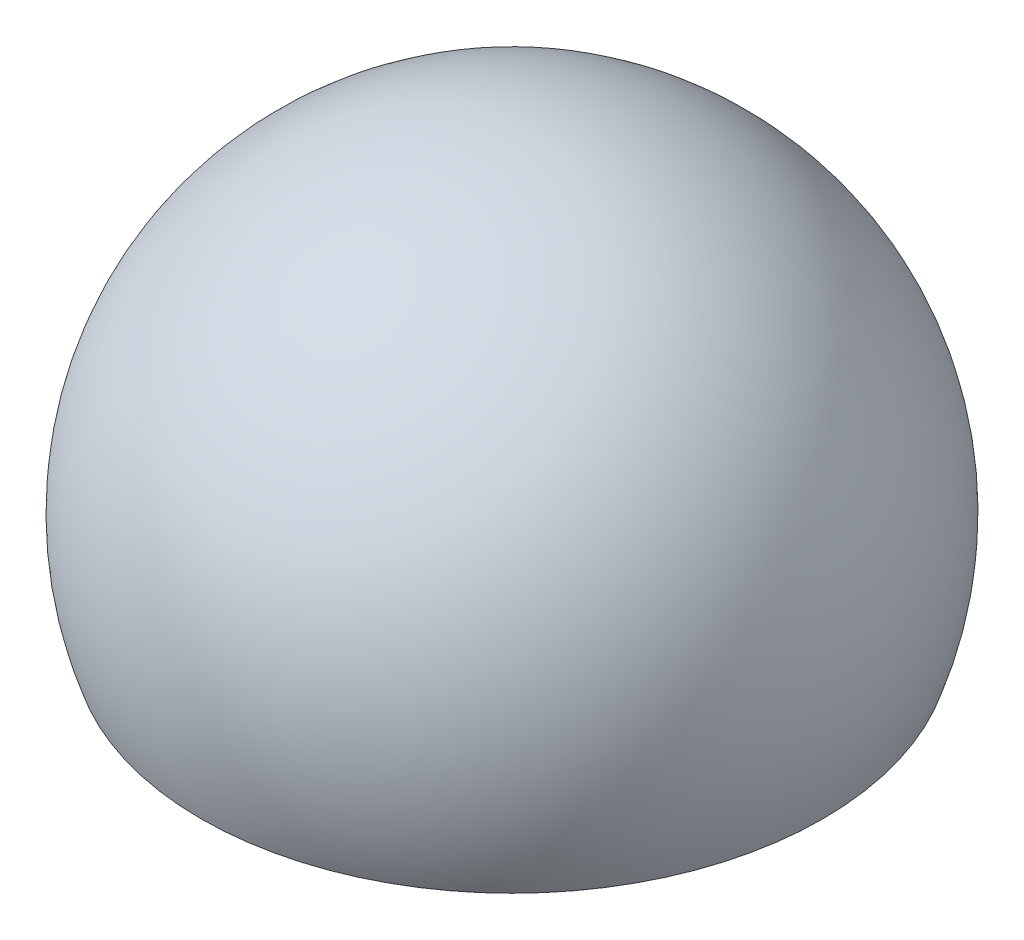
ISO-10303-21;
HEADER;
FILE_DESCRIPTION(('STEP AP214'),'2;1');
FILE_NAME('part.step','',(''),(''),'','','');
FILE_SCHEMA(('AUTOMOTIVE_DESIGN { 1 0 10303 214 1 1 1 1 }'));
ENDSEC;
DATA;
#1=APPLICATION_CONTEXT('core data for automotive mechanical design processes');
#2=APPLICATION_PROTOCOL_DEFINITION('international standard','automotive_design',2000,#1);
#3=PRODUCT_CONTEXT('',#1,'mechanical');
#4=PRODUCT('Part','Part','',(#3));
#5=PRODUCT_RELATED_PRODUCT_CATEGORY('part','',(#4));
#6=PRODUCT_DEFINITION_FORMATION('','',#4);
#7=PRODUCT_DEFINITION_CONTEXT('part definition',#1,'design');
#8=PRODUCT_DEFINITION('design','',#6,#7);
#9=PRODUCT_DEFINITION_SHAPE('','',#8);
#10=(LENGTH_UNIT() NAMED_UNIT(*) SI_UNIT(.MILLI.,.METRE.));
#11=(NAMED_UNIT(*) PLANE_ANGLE_UNIT() SI_UNIT($,.RADIAN.));
#12=(NAMED_UNIT(*) SI_UNIT($,.STERADIAN.) SOLID_ANGLE_UNIT());
#13=UNCERTAINTY_MEASURE_WITH_UNIT(LENGTH_MEASURE(1.E-05),#10,'distance_accuracy_value','');
#14=(GEOMETRIC_REPRESENTATION_CONTEXT(3) GLOBAL_UNCERTAINTY_ASSIGNED_CONTEXT((#13)) GLOBAL_UNIT_ASSIGNED_CONTEXT((#10,
#11,#12)) REPRESENTATION_CONTEXT('',''));
#15=CARTESIAN_POINT('',(0.,0.,0.));
#16=DIRECTION('',(0.,0.,1.));
#17=DIRECTION('',(1.,0.,0.));
#18=AXIS2_PLACEMENT_3D('',#15,#16,#17);
#19=CARTESIAN_POINT('',(0.,0.,0.));
#20=DIRECTION('',(0.,1.,0.));
#21=DIRECTION('',(1.,0.,0.));
#22=AXIS2_PLACEMENT_3D('',#19,#20,#21);
#23=SPHERICAL_SURFACE('',#22,2.38125);
#24=CARTESIAN_POINT('',(0.,-0.79375,0.));
#25=DIRECTION('',(0.,1.,0.));
#26=DIRECTION('',(0.,0.,1.));
#27=AXIS2_PLACEMENT_3D('',#24,#25,#26);
#28=CIRCLE('',#27,2.24506403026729);
#29=CARTESIAN_POINT('',(0.,-0.79375,2.24506403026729));
#30=VERTEX_POINT('',#29);
#31=EDGE_CURVE('E10',#30,#30,#28,.T.);
#32=ORIENTED_EDGE('',*,*,#31,.T.);
#33=EDGE_LOOP('',(#32));
#34=FACE_BOUND('',#33,.T.);
#35=ADVANCED_FACE('F24',(#34),#23,.T.);
#36=CARTESIAN_POINT('',(-2.24506403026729,-0.79375,-2.38125));
#37=DIRECTION('',(0.,1.,0.));
#38=DIRECTION('',(0.,0.,1.));
#39=AXIS2_PLACEMENT_3D('',#36,#37,#38);
#40=PLANE('',#39);
#41=ORIENTED_EDGE('',*,*,#31,.F.);
#42=EDGE_LOOP('',(#41));
#43=FACE_BOUND('',#42,.T.);
#44=ADVANCED_FACE('F32',(#43),#40,.F.);
#45=CLOSED_SHELL('',(#35,#44));
#46=MANIFOLD_SOLID_BREP('B2',#45);
#47=ADVANCED_BREP_SHAPE_REPRESENTATION('',(#18,#46),#14);
#48=SHAPE_DEFINITION_REPRESENTATION(#9,#47);
ENDSEC;
END-ISO-10303-21;
